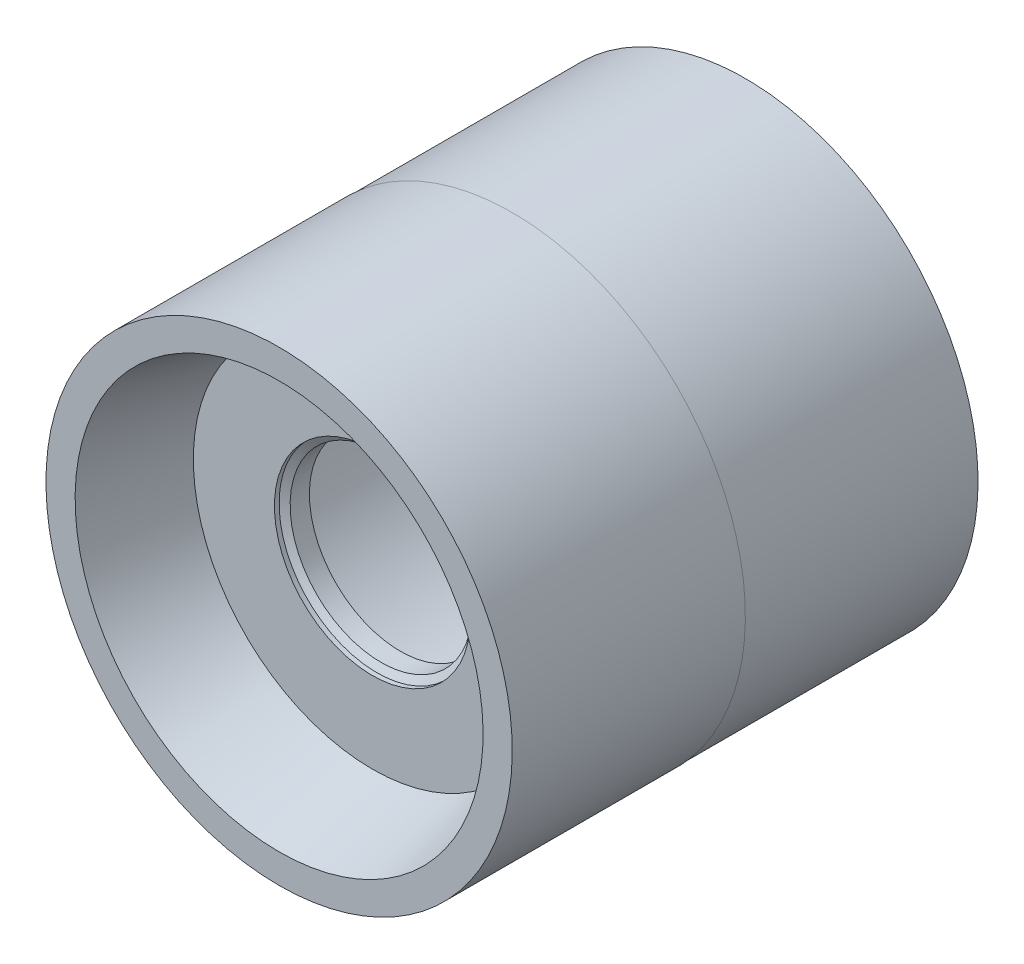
ISO-10303-21;
HEADER;
FILE_DESCRIPTION(('STEP AP214'),'2;1');
FILE_NAME('part.step','',(''),(''),'','','');
FILE_SCHEMA(('AUTOMOTIVE_DESIGN { 1 0 10303 214 1 1 1 1 }'));
ENDSEC;
DATA;
#1=APPLICATION_CONTEXT('core data for automotive mechanical design processes');
#2=APPLICATION_PROTOCOL_DEFINITION('international standard','automotive_design',2000,#1);
#3=PRODUCT_CONTEXT('',#1,'mechanical');
#4=PRODUCT('Part','Part','',(#3));
#5=PRODUCT_RELATED_PRODUCT_CATEGORY('part','',(#4));
#6=PRODUCT_DEFINITION_FORMATION('','',#4);
#7=PRODUCT_DEFINITION_CONTEXT('part definition',#1,'design');
#8=PRODUCT_DEFINITION('design','',#6,#7);
#9=PRODUCT_DEFINITION_SHAPE('','',#8);
#10=(LENGTH_UNIT() NAMED_UNIT(*) SI_UNIT(.MILLI.,.METRE.));
#11=(NAMED_UNIT(*) PLANE_ANGLE_UNIT() SI_UNIT($,.RADIAN.));
#12=(NAMED_UNIT(*) SI_UNIT($,.STERADIAN.) SOLID_ANGLE_UNIT());
#13=UNCERTAINTY_MEASURE_WITH_UNIT(LENGTH_MEASURE(1.E-05),#10,'distance_accuracy_value','');
#14=(GEOMETRIC_REPRESENTATION_CONTEXT(3) GLOBAL_UNCERTAINTY_ASSIGNED_CONTEXT((#13)) GLOBAL_UNIT_ASSIGNED_CONTEXT((#10,
#11,#12)) REPRESENTATION_CONTEXT('',''));
#15=CARTESIAN_POINT('',(0.,0.,0.));
#16=DIRECTION('',(0.,0.,1.));
#17=DIRECTION('',(1.,0.,0.));
#18=AXIS2_PLACEMENT_3D('',#15,#16,#17);
#19=CARTESIAN_POINT('',(0.,0.,0.));
#20=DIRECTION('',(0.,0.,-1.));
#21=DIRECTION('',(0.,1.,0.));
#22=AXIS2_PLACEMENT_3D('',#19,#20,#21);
#23=CYLINDRICAL_SURFACE('',#22,4.953);
#24=CARTESIAN_POINT('',(0.,0.,-5.55397045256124));
#25=DIRECTION('',(0.,0.,1.));
#26=DIRECTION('',(1.,0.,0.));
#27=AXIS2_PLACEMENT_3D('',#24,#25,#26);
#28=CIRCLE('',#27,4.953);
#29=CARTESIAN_POINT('',(4.953,0.,-5.55397045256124));
#30=VERTEX_POINT('',#29);
#31=EDGE_CURVE('E179',#30,#30,#28,.T.);
#32=ORIENTED_EDGE('',*,*,#31,.T.);
#33=EDGE_LOOP('',(#32));
#34=FACE_BOUND('',#33,.T.);
#35=CARTESIAN_POINT('',(0.,0.,-6.604));
#36=DIRECTION('',(0.,0.,-1.));
#37=DIRECTION('',(0.,1.,0.));
#38=AXIS2_PLACEMENT_3D('',#35,#36,#37);
#39=CIRCLE('',#38,4.953);
#40=CARTESIAN_POINT('',(0.,4.95299999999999,-6.604));
#41=VERTEX_POINT('',#40);
#42=EDGE_CURVE('E39',#41,#41,#39,.F.);
#43=ORIENTED_EDGE('',*,*,#42,.F.);
#44=EDGE_LOOP('',(#43));
#45=FACE_BOUND('',#44,.T.);
#46=ADVANCED_FACE('F35',(#34,#45),#23,.F.);
#47=CARTESIAN_POINT('',(0.,12.6746,-25.4));
#48=DIRECTION('',(0.,0.,1.));
#49=DIRECTION('',(0.,-1.,0.));
#50=AXIS2_PLACEMENT_3D('',#47,#48,#49);
#51=PLANE('',#50);
#52=CARTESIAN_POINT('',(0.,0.,-25.4));
#53=DIRECTION('',(0.,0.,1.));
#54=DIRECTION('',(0.,-1.,0.));
#55=AXIS2_PLACEMENT_3D('',#52,#53,#54);
#56=CIRCLE('',#55,12.6746);
#57=CARTESIAN_POINT('',(0.,-12.6746,-25.4));
#58=VERTEX_POINT('',#57);
#59=EDGE_CURVE('E164',#58,#58,#56,.T.);
#60=ORIENTED_EDGE('',*,*,#59,.F.);
#61=EDGE_LOOP('',(#60));
#62=FACE_BOUND('',#61,.T.);
#63=DIRECTION('',(0.,-1.,0.));
#64=VECTOR('',#63,1.);
#65=CARTESIAN_POINT('',(1.778,12.6746,-25.4));
#66=LINE('',#65,#64);
#67=CARTESIAN_POINT('',(1.778,-9.874198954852,-25.4));
#68=VERTEX_POINT('',#67);
#69=CARTESIAN_POINT('',(1.778,-12.192,-25.4));
#70=VERTEX_POINT('',#69);
#71=EDGE_CURVE('E137',#68,#70,#66,.T.);
#72=ORIENTED_EDGE('',*,*,#71,.F.);
#73=CARTESIAN_POINT('',(0.,0.,-25.4));
#74=DIRECTION('',(0.,0.,-1.));
#75=DIRECTION('',(0.,1.,0.));
#76=AXIS2_PLACEMENT_3D('',#73,#74,#75);
#77=CIRCLE('',#76,10.033);
#78=CARTESIAN_POINT('',(1.778,9.87419895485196,-25.4));
#79=VERTEX_POINT('',#78);
#80=EDGE_CURVE('E124',#79,#68,#77,.T.);
#81=ORIENTED_EDGE('',*,*,#80,.F.);
#82=CARTESIAN_POINT('',(1.778,12.192,-25.4));
#83=VERTEX_POINT('',#82);
#84=EDGE_CURVE('E135',#83,#79,#66,.T.);
#85=ORIENTED_EDGE('',*,*,#84,.F.);
#86=DIRECTION('',(1.,0.,0.));
#87=VECTOR('',#86,1.);
#88=CARTESIAN_POINT('',(0.,12.192,-25.4));
#89=LINE('',#88,#87);
#90=CARTESIAN_POINT('',(-1.778,12.192,-25.4));
#91=VERTEX_POINT('',#90);
#92=EDGE_CURVE('E145',#91,#83,#89,.T.);
#93=ORIENTED_EDGE('',*,*,#92,.F.);
#94=DIRECTION('',(0.,1.,0.));
#95=VECTOR('',#94,1.);
#96=CARTESIAN_POINT('',(-1.778,12.6746,-25.4));
#97=LINE('',#96,#95);
#98=CARTESIAN_POINT('',(-1.778,9.87419895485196,-25.4));
#99=VERTEX_POINT('',#98);
#100=EDGE_CURVE('E44',#99,#91,#97,.T.);
#101=ORIENTED_EDGE('',*,*,#100,.F.);
#102=CARTESIAN_POINT('',(-1.778,-9.874198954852,-25.4));
#103=VERTEX_POINT('',#102);
#104=EDGE_CURVE('E139',#103,#99,#77,.T.);
#105=ORIENTED_EDGE('',*,*,#104,.F.);
#106=CARTESIAN_POINT('',(-1.778,-12.192,-25.4));
#107=VERTEX_POINT('',#106);
#108=EDGE_CURVE('E148',#107,#103,#97,.T.);
#109=ORIENTED_EDGE('',*,*,#108,.F.);
#110=DIRECTION('',(1.,0.,0.));
#111=VECTOR('',#110,1.);
#112=CARTESIAN_POINT('',(0.,-12.192,-25.4));
#113=LINE('',#112,#111);
#114=EDGE_CURVE('E151',#107,#70,#113,.T.);
#115=ORIENTED_EDGE('',*,*,#114,.T.);
#116=EDGE_LOOP('',(#72,#81,#85,#93,#101,#105,#109,#115));
#117=FACE_BOUND('',#116,.T.);
#118=ADVANCED_FACE('F133',(#62,#117),#51,.F.);
#119=CARTESIAN_POINT('',(0.,0.,0.));
#120=DIRECTION('',(0.,0.,1.));
#121=DIRECTION('',(0.,-1.,0.));
#122=AXIS2_PLACEMENT_3D('',#119,#120,#121);
#123=CYLINDRICAL_SURFACE('',#122,12.7);
#124=CARTESIAN_POINT('',(0.,0.,0.));
#125=DIRECTION('',(0.,0.,1.));
#126=DIRECTION('',(0.,-1.,0.));
#127=AXIS2_PLACEMENT_3D('',#124,#125,#126);
#128=CIRCLE('',#127,12.7);
#129=CARTESIAN_POINT('',(0.,-12.7,0.));
#130=VERTEX_POINT('',#129);
#131=EDGE_CURVE('E173',#130,#130,#128,.T.);
#132=ORIENTED_EDGE('',*,*,#131,.F.);
#133=EDGE_LOOP('',(#132));
#134=FACE_BOUND('',#133,.T.);
#135=CARTESIAN_POINT('',(0.,0.,-12.7));
#136=DIRECTION('',(0.,0.,1.));
#137=DIRECTION('',(0.,-1.,0.));
#138=AXIS2_PLACEMENT_3D('',#135,#136,#137);
#139=CIRCLE('',#138,12.7);
#140=CARTESIAN_POINT('',(0.,-12.7,-12.7));
#141=VERTEX_POINT('',#140);
#142=EDGE_CURVE('E156',#141,#141,#139,.T.);
#143=ORIENTED_EDGE('',*,*,#142,.T.);
#144=EDGE_LOOP('',(#143));
#145=FACE_BOUND('',#144,.T.);
#146=ADVANCED_FACE('F37',(#134,#145),#123,.T.);
#147=CARTESIAN_POINT('',(0.,12.7,-12.7));
#148=DIRECTION('',(0.,0.,1.));
#149=DIRECTION('',(0.,-1.,0.));
#150=AXIS2_PLACEMENT_3D('',#147,#148,#149);
#151=PLANE('',#150);
#152=ORIENTED_EDGE('',*,*,#142,.F.);
#153=EDGE_LOOP('',(#152));
#154=FACE_BOUND('',#153,.T.);
#155=CARTESIAN_POINT('',(0.,0.,-12.7));
#156=DIRECTION('',(0.,0.,1.));
#157=DIRECTION('',(0.,-1.,0.));
#158=AXIS2_PLACEMENT_3D('',#155,#156,#157);
#159=CIRCLE('',#158,12.6746);
#160=CARTESIAN_POINT('',(0.,-12.6746,-12.7));
#161=VERTEX_POINT('',#160);
#162=EDGE_CURVE('E159',#161,#161,#159,.T.);
#163=ORIENTED_EDGE('',*,*,#162,.T.);
#164=EDGE_LOOP('',(#163));
#165=FACE_BOUND('',#164,.T.);
#166=ADVANCED_FACE('F309',(#154,#165),#151,.F.);
#167=CARTESIAN_POINT('',(0.,0.,0.));
#168=DIRECTION('',(0.,0.,1.));
#169=DIRECTION('',(0.,-1.,0.));
#170=AXIS2_PLACEMENT_3D('',#167,#168,#169);
#171=CYLINDRICAL_SURFACE('',#170,12.6746);
#172=ORIENTED_EDGE('',*,*,#162,.F.);
#173=EDGE_LOOP('',(#172));
#174=FACE_BOUND('',#173,.T.);
#175=ORIENTED_EDGE('',*,*,#59,.T.);
#176=EDGE_LOOP('',(#175));
#177=FACE_BOUND('',#176,.T.);
#178=ADVANCED_FACE('F303',(#174,#177),#171,.T.);
#179=CARTESIAN_POINT('',(0.,9.75131810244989,-5.08));
#180=DIRECTION('',(0.,0.,-1.));
#181=DIRECTION('',(0.,1.,0.));
#182=AXIS2_PLACEMENT_3D('',#179,#180,#181);
#183=PLANE('',#182);
#184=CARTESIAN_POINT('',(0.,0.,-5.08));
#185=DIRECTION('',(0.,0.,1.));
#186=DIRECTION('',(1.,0.,0.));
#187=AXIS2_PLACEMENT_3D('',#184,#185,#186);
#188=CIRCLE('',#187,5.334);
#189=CARTESIAN_POINT('',(5.334,0.,-5.08));
#190=VERTEX_POINT('',#189);
#191=EDGE_CURVE('E176',#190,#190,#188,.T.);
#192=ORIENTED_EDGE('',*,*,#191,.F.);
#193=EDGE_LOOP('',(#192));
#194=FACE_BOUND('',#193,.T.);
#195=CARTESIAN_POINT('',(0.,0.,-5.07999999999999));
#196=DIRECTION('',(0.,0.,1.));
#197=DIRECTION('',(0.,-1.,0.));
#198=AXIS2_PLACEMENT_3D('',#195,#196,#197);
#199=CIRCLE('',#198,9.7513181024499);
#200=CARTESIAN_POINT('',(0.,-9.7513181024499,-5.07999999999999));
#201=VERTEX_POINT('',#200);
#202=EDGE_CURVE('E167',#201,#201,#199,.T.);
#203=ORIENTED_EDGE('',*,*,#202,.T.);
#204=EDGE_LOOP('',(#203));
#205=FACE_BOUND('',#204,.T.);
#206=ADVANCED_FACE('F299',(#194,#205),#183,.F.);
#207=CARTESIAN_POINT('',(0.,0.,0.));
#208=DIRECTION('',(0.,0.,1.));
#209=DIRECTION('',(0.,-1.,0.));
#210=AXIS2_PLACEMENT_3D('',#207,#208,#209);
#211=CONICAL_SURFACE('',#210,11.1125,0.261799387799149);
#212=ORIENTED_EDGE('',*,*,#202,.F.);
#213=EDGE_LOOP('',(#212));
#214=FACE_BOUND('',#213,.T.);
#215=CARTESIAN_POINT('',(0.,0.,0.));
#216=DIRECTION('',(0.,0.,1.));
#217=DIRECTION('',(0.,-1.,0.));
#218=AXIS2_PLACEMENT_3D('',#215,#216,#217);
#219=CIRCLE('',#218,11.1125);
#220=CARTESIAN_POINT('',(0.,-11.1125,0.));
#221=VERTEX_POINT('',#220);
#222=EDGE_CURVE('E170',#221,#221,#219,.T.);
#223=ORIENTED_EDGE('',*,*,#222,.T.);
#224=EDGE_LOOP('',(#223));
#225=FACE_BOUND('',#224,.T.);
#226=ADVANCED_FACE('F295',(#214,#225),#211,.F.);
#227=CARTESIAN_POINT('',(0.,11.1125,0.));
#228=DIRECTION('',(0.,0.,-1.));
#229=DIRECTION('',(0.,1.,0.));
#230=AXIS2_PLACEMENT_3D('',#227,#228,#229);
#231=PLANE('',#230);
#232=ORIENTED_EDGE('',*,*,#222,.F.);
#233=EDGE_LOOP('',(#232));
#234=FACE_BOUND('',#233,.T.);
#235=ORIENTED_EDGE('',*,*,#131,.T.);
#236=EDGE_LOOP('',(#235));
#237=FACE_BOUND('',#236,.T.);
#238=ADVANCED_FACE('F288',(#234,#237),#231,.F.);
#239=CARTESIAN_POINT('',(0.,0.,-5.334));
#240=DIRECTION('',(0.,0.,1.));
#241=DIRECTION('',(1.,0.,0.));
#242=AXIS2_PLACEMENT_3D('',#239,#240,#241);
#243=CYLINDRICAL_SURFACE('',#242,5.334);
#244=CARTESIAN_POINT('',(0.,0.,-5.334));
#245=DIRECTION('',(0.,0.,1.));
#246=DIRECTION('',(1.,0.,0.));
#247=AXIS2_PLACEMENT_3D('',#244,#245,#246);
#248=CIRCLE('',#247,5.334);
#249=CARTESIAN_POINT('',(5.334,0.,-5.334));
#250=VERTEX_POINT('',#249);
#251=EDGE_CURVE('E182',#250,#250,#248,.T.);
#252=ORIENTED_EDGE('',*,*,#251,.F.);
#253=EDGE_LOOP('',(#252));
#254=FACE_BOUND('',#253,.T.);
#255=ORIENTED_EDGE('',*,*,#191,.T.);
#256=EDGE_LOOP('',(#255));
#257=FACE_BOUND('',#256,.T.);
#258=ADVANCED_FACE('F284',(#254,#257),#243,.F.);
#259=CARTESIAN_POINT('',(0.,0.,-5.334));
#260=DIRECTION('',(0.,0.,1.));
#261=DIRECTION('',(1.,0.,0.));
#262=AXIS2_PLACEMENT_3D('',#259,#260,#261);
#263=CONICAL_SURFACE('',#262,5.334,1.0471975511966);
#264=ORIENTED_EDGE('',*,*,#251,.T.);
#265=EDGE_LOOP('',(#264));
#266=FACE_BOUND('',#265,.T.);
#267=ORIENTED_EDGE('',*,*,#31,.F.);
#268=EDGE_LOOP('',(#267));
#269=FACE_BOUND('',#268,.T.);
#270=ADVANCED_FACE('F281',(#266,#269),#263,.F.);
#271=CARTESIAN_POINT('',(-0.127,-12.192,-26.543));
#272=DIRECTION('',(0.,-1.,0.));
#273=DIRECTION('',(0.,0.,-1.));
#274=AXIS2_PLACEMENT_3D('',#271,#272,#273);
#275=PLANE('',#274);
#276=DIRECTION('',(0.,0.,1.));
#277=VECTOR('',#276,1.);
#278=CARTESIAN_POINT('',(-1.778,-12.192,-20.828));
#279=LINE('',#278,#277);
#280=CARTESIAN_POINT('',(-1.778,-12.192,-20.828));
#281=VERTEX_POINT('',#280);
#282=EDGE_CURVE('E220',#107,#281,#279,.T.);
#283=ORIENTED_EDGE('',*,*,#282,.T.);
#284=CARTESIAN_POINT('',(-0.127,-12.192,-20.828));
#285=DIRECTION('',(0.,1.,0.));
#286=DIRECTION('',(0.,0.,1.));
#287=AXIS2_PLACEMENT_3D('',#284,#285,#286);
#288=CIRCLE('',#287,1.651);
#289=CARTESIAN_POINT('',(-0.127,-12.192,-19.177));
#290=VERTEX_POINT('',#289);
#291=EDGE_CURVE('E217',#281,#290,#288,.T.);
#292=ORIENTED_EDGE('',*,*,#291,.T.);
#293=DIRECTION('',(1.,0.,0.));
#294=VECTOR('',#293,1.);
#295=CARTESIAN_POINT('',(0.127000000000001,-12.192,-19.177));
#296=LINE('',#295,#294);
#297=CARTESIAN_POINT('',(0.127000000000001,-12.192,-19.177));
#298=VERTEX_POINT('',#297);
#299=EDGE_CURVE('E214',#290,#298,#296,.T.);
#300=ORIENTED_EDGE('',*,*,#299,.T.);
#301=CARTESIAN_POINT('',(0.127000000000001,-12.192,-20.828));
#302=DIRECTION('',(0.,1.,0.));
#303=DIRECTION('',(0.,0.,1.));
#304=AXIS2_PLACEMENT_3D('',#301,#302,#303);
#305=CIRCLE('',#304,1.651);
#306=CARTESIAN_POINT('',(1.778,-12.192,-20.828));
#307=VERTEX_POINT('',#306);
#308=EDGE_CURVE('E211',#298,#307,#305,.T.);
#309=ORIENTED_EDGE('',*,*,#308,.T.);
#310=DIRECTION('',(0.,0.,-1.));
#311=VECTOR('',#310,1.);
#312=CARTESIAN_POINT('',(1.778,-12.192,-26.543));
#313=LINE('',#312,#311);
#314=EDGE_CURVE('E209',#307,#70,#313,.T.);
#315=ORIENTED_EDGE('',*,*,#314,.T.);
#316=ORIENTED_EDGE('',*,*,#114,.F.);
#317=EDGE_LOOP('',(#283,#292,#300,#309,#315,#316));
#318=FACE_BOUND('',#317,.T.);
#319=ADVANCED_FACE('F245',(#318),#275,.F.);
#320=CARTESIAN_POINT('',(1.778,12.192,-26.543));
#321=DIRECTION('',(-1.,0.,0.));
#322=DIRECTION('',(0.,0.,1.));
#323=AXIS2_PLACEMENT_3D('',#320,#321,#322);
#324=PLANE('',#323);
#325=DIRECTION('',(0.,0.,-1.));
#326=VECTOR('',#325,1.);
#327=CARTESIAN_POINT('',(1.778,-9.87419895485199,-6.60399999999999));
#328=LINE('',#327,#326);
#329=CARTESIAN_POINT('',(1.778,-9.874198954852,-20.828));
#330=VERTEX_POINT('',#329);
#331=EDGE_CURVE('E223',#68,#330,#328,.F.);
#332=ORIENTED_EDGE('',*,*,#331,.F.);
#333=ORIENTED_EDGE('',*,*,#71,.T.);
#334=ORIENTED_EDGE('',*,*,#314,.F.);
#335=DIRECTION('',(0.,-1.,0.));
#336=VECTOR('',#335,1.);
#337=CARTESIAN_POINT('',(1.778,12.192,-20.828));
#338=LINE('',#337,#336);
#339=EDGE_CURVE('E199',#330,#307,#338,.T.);
#340=ORIENTED_EDGE('',*,*,#339,.F.);
#341=EDGE_LOOP('',(#332,#333,#334,#340));
#342=FACE_BOUND('',#341,.T.);
#343=ADVANCED_FACE('F278',(#342),#324,.T.);
#344=CARTESIAN_POINT('',(-1.778,12.192,-20.828));
#345=DIRECTION('',(1.,0.,0.));
#346=DIRECTION('',(0.,0.,-1.));
#347=AXIS2_PLACEMENT_3D('',#344,#345,#346);
#348=PLANE('',#347);
#349=DIRECTION('',(0.,0.,-1.));
#350=VECTOR('',#349,1.);
#351=CARTESIAN_POINT('',(-1.778,-9.87419895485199,-6.60399999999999));
#352=LINE('',#351,#350);
#353=CARTESIAN_POINT('',(-1.778,-9.874198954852,-20.828));
#354=VERTEX_POINT('',#353);
#355=EDGE_CURVE('E225',#354,#103,#352,.T.);
#356=ORIENTED_EDGE('',*,*,#355,.F.);
#357=DIRECTION('',(0.,-1.,0.));
#358=VECTOR('',#357,1.);
#359=CARTESIAN_POINT('',(-1.778,12.192,-20.828));
#360=LINE('',#359,#358);
#361=EDGE_CURVE('E188',#354,#281,#360,.T.);
#362=ORIENTED_EDGE('',*,*,#361,.T.);
#363=ORIENTED_EDGE('',*,*,#282,.F.);
#364=ORIENTED_EDGE('',*,*,#108,.T.);
#365=EDGE_LOOP('',(#356,#362,#363,#364));
#366=FACE_BOUND('',#365,.T.);
#367=ADVANCED_FACE('F274',(#366),#348,.T.);
#368=CARTESIAN_POINT('',(0.127000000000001,12.192,-20.828));
#369=DIRECTION('',(0.,-1.,0.));
#370=DIRECTION('',(0.,0.,-1.));
#371=AXIS2_PLACEMENT_3D('',#368,#369,#370);
#372=CYLINDRICAL_SURFACE('',#371,1.651);
#373=CARTESIAN_POINT('',(1.778,-9.874198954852,-20.828));
#374=CARTESIAN_POINT('',(1.77800012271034,-9.87419704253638,-20.7819476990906));
#375=CARTESIAN_POINT('',(1.77607193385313,-9.87454633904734,-20.7359178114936));
#376=CARTESIAN_POINT('',(1.7683824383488,-9.87592705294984,-20.644194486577));
#377=CARTESIAN_POINT('',(1.76262153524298,-9.87695839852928,-20.5985010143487));
#378=CARTESIAN_POINT('',(1.73965937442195,-9.88103896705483,-20.4625550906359));
#379=CARTESIAN_POINT('',(1.71677841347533,-9.8850749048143,-20.3732243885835));
#380=CARTESIAN_POINT('',(1.65655765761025,-9.89534368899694,-20.1997490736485));
#381=CARTESIAN_POINT('',(1.61921480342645,-9.9015770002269,-20.1156055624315));
#382=CARTESIAN_POINT('',(1.53115725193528,-9.91557496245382,-19.9547611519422));
#383=CARTESIAN_POINT('',(1.48044179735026,-9.92333970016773,-19.8780606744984));
#384=CARTESIAN_POINT('',(1.36650190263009,-9.93967285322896,-19.7334717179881));
#385=CARTESIAN_POINT('',(1.30316088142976,-9.94824833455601,-19.6656759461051));
#386=CARTESIAN_POINT('',(1.16601038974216,-9.9652533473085,-19.5416059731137));
#387=CARTESIAN_POINT('',(1.09219882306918,-9.97368284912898,-19.4853340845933));
#388=CARTESIAN_POINT('',(0.935504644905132,-9.98960282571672,-19.3854943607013));
#389=CARTESIAN_POINT('',(0.852554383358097,-9.99708527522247,-19.3420314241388));
#390=CARTESIAN_POINT('',(0.680406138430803,-10.01027307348,-19.2697176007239));
#391=CARTESIAN_POINT('',(0.59121237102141,-10.0159796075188,-19.2408569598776));
#392=CARTESIAN_POINT('',(0.439091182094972,-10.023574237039,-19.205549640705));
#393=CARTESIAN_POINT('',(0.377148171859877,-10.0261008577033,-19.1948556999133));
#394=CARTESIAN_POINT('',(0.252482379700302,-10.0300184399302,-19.1805794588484));
#395=CARTESIAN_POINT('',(0.189760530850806,-10.0314106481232,-19.1769893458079));
#396=CARTESIAN_POINT('',(0.127000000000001,-10.0321961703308,-19.177));
#397=B_SPLINE_CURVE_WITH_KNOTS('',3,(#373,#374,#375,#376,#377,#378,#379,#380,#381,#382,#383,
#384,#385,#386,#387,#388,#389,#390,#391,#392,#393,#394,#395,#396),.UNSPECIFIED.,.F.,.F.,(4,2,2,
2,2,2,2,2,2,2,2,4),(0.,0.138070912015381,0.276127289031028,0.551610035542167,0.827151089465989,
1.10270775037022,1.38093768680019,1.65922340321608,1.93972855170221,2.22004608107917,
2.4083851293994,2.59651692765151),.UNSPECIFIED.);
#398=CARTESIAN_POINT('',(0.127000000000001,-10.0321961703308,-19.177));
#399=VERTEX_POINT('',#398);
#400=EDGE_CURVE('E227',#330,#399,#397,.T.);
#401=ORIENTED_EDGE('',*,*,#400,.F.);
#402=ORIENTED_EDGE('',*,*,#339,.T.);
#403=ORIENTED_EDGE('',*,*,#308,.F.);
#404=DIRECTION('',(0.,-1.,0.));
#405=VECTOR('',#404,1.);
#406=CARTESIAN_POINT('',(0.127000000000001,12.192,-19.177));
#407=LINE('',#406,#405);
#408=EDGE_CURVE('E196',#399,#298,#407,.T.);
#409=ORIENTED_EDGE('',*,*,#408,.F.);
#410=EDGE_LOOP('',(#401,#402,#403,#409));
#411=FACE_BOUND('',#410,.T.);
#412=ADVANCED_FACE('F236',(#411),#372,.F.);
#413=CARTESIAN_POINT('',(0.127000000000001,12.192,-19.177));
#414=DIRECTION('',(0.,0.,-1.));
#415=DIRECTION('',(-1.,0.,0.));
#416=AXIS2_PLACEMENT_3D('',#413,#414,#415);
#417=PLANE('',#416);
#418=CARTESIAN_POINT('',(0.,0.,-19.177));
#419=DIRECTION('',(0.,0.,-1.));
#420=DIRECTION('',(-1.,0.,0.));
#421=AXIS2_PLACEMENT_3D('',#418,#419,#420);
#422=CIRCLE('',#421,10.033);
#423=CARTESIAN_POINT('',(-0.127,-10.0321961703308,-19.177));
#424=VERTEX_POINT('',#423);
#425=EDGE_CURVE('E234',#399,#424,#422,.T.);
#426=ORIENTED_EDGE('',*,*,#425,.F.);
#427=ORIENTED_EDGE('',*,*,#408,.T.);
#428=ORIENTED_EDGE('',*,*,#299,.F.);
#429=DIRECTION('',(0.,-1.,0.));
#430=VECTOR('',#429,1.);
#431=CARTESIAN_POINT('',(-0.127,12.192,-19.177));
#432=LINE('',#431,#430);
#433=EDGE_CURVE('E192',#424,#290,#432,.T.);
#434=ORIENTED_EDGE('',*,*,#433,.F.);
#435=EDGE_LOOP('',(#426,#427,#428,#434));
#436=FACE_BOUND('',#435,.T.);
#437=ADVANCED_FACE('F272',(#436),#417,.T.);
#438=CARTESIAN_POINT('',(-0.127,12.192,-20.828));
#439=DIRECTION('',(0.,-1.,0.));
#440=DIRECTION('',(0.,0.,-1.));
#441=AXIS2_PLACEMENT_3D('',#438,#439,#440);
#442=CYLINDRICAL_SURFACE('',#441,1.651);
#443=CARTESIAN_POINT('',(-0.127,-10.0321961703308,-19.177));
#444=CARTESIAN_POINT('',(-0.173183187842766,-10.0316133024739,-19.1769999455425));
#445=CARTESIAN_POINT('',(-0.219339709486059,-10.0307078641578,-19.1789390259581));
#446=CARTESIAN_POINT('',(-0.311307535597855,-10.0282744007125,-19.1866703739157));
#447=CARTESIAN_POINT('',(-0.357118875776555,-10.0267464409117,-19.1924622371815));
#448=CARTESIAN_POINT('',(-0.493410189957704,-10.0212704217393,-19.2155458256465));
#449=CARTESIAN_POINT('',(-0.582954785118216,-10.0164274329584,-19.2385458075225));
#450=CARTESIAN_POINT('',(-0.756820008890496,-10.0047952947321,-19.299073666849));
#451=CARTESIAN_POINT('',(-0.841139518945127,-9.99800573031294,-19.3366046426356));
#452=CARTESIAN_POINT('',(-1.00229074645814,-9.98313840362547,-19.4251052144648));
#453=CARTESIAN_POINT('',(-1.07912213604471,-9.97506058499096,-19.4760753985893));
#454=CARTESIAN_POINT('',(-1.22386208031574,-9.95834404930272,-19.5905485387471));
#455=CARTESIAN_POINT('',(-1.29168459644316,-9.94970095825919,-19.6541596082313));
#456=CARTESIAN_POINT('',(-1.41574744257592,-9.93280813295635,-19.7918912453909));
#457=CARTESIAN_POINT('',(-1.47198556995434,-9.92455847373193,-19.8660138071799));
#458=CARTESIAN_POINT('',(-1.57155224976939,-9.90928214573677,-20.0231576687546));
#459=CARTESIAN_POINT('',(-1.61480899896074,-9.90226236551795,-20.1062251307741));
#460=CARTESIAN_POINT('',(-1.68669177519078,-9.89027280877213,-20.2785773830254));
#461=CARTESIAN_POINT('',(-1.71532801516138,-9.8853016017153,-20.3678577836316));
#462=CARTESIAN_POINT('',(-1.75009047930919,-9.87919385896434,-20.5193956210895));
#463=CARTESIAN_POINT('',(-1.76054594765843,-9.87733028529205,-20.580665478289));
#464=CARTESIAN_POINT('',(-1.77450197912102,-9.87482889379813,-20.7039472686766));
#465=CARTESIAN_POINT('',(-1.7780102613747,-9.87418971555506,-20.7659583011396));
#466=CARTESIAN_POINT('',(-1.778,-9.874198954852,-20.828));
#467=B_SPLINE_CURVE_WITH_KNOTS('',3,(#443,#444,#445,#446,#447,#448,#449,#450,#451,#452,#453,
#454,#455,#456,#457,#458,#459,#460,#461,#462,#463,#464,#465,#466),.UNSPECIFIED.,.F.,.F.,(4,2,2,
2,2,2,2,2,2,2,2,4),(0.,0.138474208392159,0.276933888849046,0.553239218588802,0.829603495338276,
1.10597986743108,1.3848304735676,1.66373405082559,1.94415302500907,2.22437584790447,
2.41054677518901,2.59651072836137),.UNSPECIFIED.);
#468=EDGE_CURVE('E262',#424,#354,#467,.T.);
#469=ORIENTED_EDGE('',*,*,#468,.F.);
#470=ORIENTED_EDGE('',*,*,#433,.T.);
#471=ORIENTED_EDGE('',*,*,#291,.F.);
#472=ORIENTED_EDGE('',*,*,#361,.F.);
#473=EDGE_LOOP('',(#469,#470,#471,#472));
#474=FACE_BOUND('',#473,.T.);
#475=ADVANCED_FACE('F267',(#474),#442,.F.);
#476=CARTESIAN_POINT('',(-1.778,9.87419895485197,-20.828));
#477=CARTESIAN_POINT('',(-1.77800012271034,9.87419704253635,-20.7819476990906));
#478=CARTESIAN_POINT('',(-1.77607193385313,9.87454633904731,-20.7359178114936));
#479=CARTESIAN_POINT('',(-1.7683824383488,9.87592705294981,-20.644194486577));
#480=CARTESIAN_POINT('',(-1.76262153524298,9.87695839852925,-20.5985010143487));
#481=CARTESIAN_POINT('',(-1.73965937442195,9.8810389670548,-20.4625550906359));
#482=CARTESIAN_POINT('',(-1.71677841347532,9.88507490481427,-20.3732243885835));
#483=CARTESIAN_POINT('',(-1.65655765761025,9.89534368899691,-20.1997490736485));
#484=CARTESIAN_POINT('',(-1.61921480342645,9.90157700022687,-20.1156055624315));
#485=CARTESIAN_POINT('',(-1.53115725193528,9.91557496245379,-19.9547611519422));
#486=CARTESIAN_POINT('',(-1.48044179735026,9.9233397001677,-19.8780606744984));
#487=CARTESIAN_POINT('',(-1.36650190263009,9.93967285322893,-19.7334717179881));
#488=CARTESIAN_POINT('',(-1.30316088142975,9.94824833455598,-19.6656759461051));
#489=CARTESIAN_POINT('',(-1.16601038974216,9.96525334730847,-19.5416059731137));
#490=CARTESIAN_POINT('',(-1.09219882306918,9.97368284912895,-19.4853340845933));
#491=CARTESIAN_POINT('',(-0.935504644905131,9.9896028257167,-19.3854943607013));
#492=CARTESIAN_POINT('',(-0.852554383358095,9.99708527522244,-19.3420314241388));
#493=CARTESIAN_POINT('',(-0.680406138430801,10.01027307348,-19.2697176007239));
#494=CARTESIAN_POINT('',(-0.591212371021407,10.0159796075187,-19.2408569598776));
#495=CARTESIAN_POINT('',(-0.43909118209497,10.023574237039,-19.205549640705));
#496=CARTESIAN_POINT('',(-0.377148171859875,10.0261008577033,-19.1948556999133));
#497=CARTESIAN_POINT('',(-0.252482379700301,10.0300184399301,-19.1805794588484));
#498=CARTESIAN_POINT('',(-0.189760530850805,10.0314106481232,-19.1769893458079));
#499=CARTESIAN_POINT('',(-0.127000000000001,10.0321961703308,-19.177));
#500=B_SPLINE_CURVE_WITH_KNOTS('',3,(#476,#477,#478,#479,#480,#481,#482,#483,#484,#485,#486,
#487,#488,#489,#490,#491,#492,#493,#494,#495,#496,#497,#498,#499),.UNSPECIFIED.,.F.,.F.,(4,2,2,
2,2,2,2,2,2,2,2,4),(0.,0.138070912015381,0.276127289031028,0.551610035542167,0.827151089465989,
1.10270775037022,1.38093768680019,1.65922340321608,1.93972855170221,2.22004608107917,
2.4083851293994,2.59651692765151),.UNSPECIFIED.);
#501=CARTESIAN_POINT('',(-1.778,9.87419895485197,-20.828));
#502=VERTEX_POINT('',#501);
#503=CARTESIAN_POINT('',(-0.127,10.0321961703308,-19.177));
#504=VERTEX_POINT('',#503);
#505=EDGE_CURVE('E256',#502,#504,#500,.T.);
#506=ORIENTED_EDGE('',*,*,#505,.F.);
#507=CARTESIAN_POINT('',(-1.778,12.192,-20.828));
#508=VERTEX_POINT('',#507);
#509=EDGE_CURVE('E185',#508,#502,#360,.T.);
#510=ORIENTED_EDGE('',*,*,#509,.F.);
#511=CARTESIAN_POINT('',(-0.127,12.192,-20.828));
#512=DIRECTION('',(0.,1.,0.));
#513=DIRECTION('',(0.,0.,1.));
#514=AXIS2_PLACEMENT_3D('',#511,#512,#513);
#515=CIRCLE('',#514,1.651);
#516=CARTESIAN_POINT('',(-0.127,12.192,-19.177));
#517=VERTEX_POINT('',#516);
#518=EDGE_CURVE('E205',#508,#517,#515,.T.);
#519=ORIENTED_EDGE('',*,*,#518,.T.);
#520=EDGE_CURVE('E189',#517,#504,#432,.T.);
#521=ORIENTED_EDGE('',*,*,#520,.T.);
#522=EDGE_LOOP('',(#506,#510,#519,#521));
#523=FACE_BOUND('',#522,.T.);
#524=ADVANCED_FACE('F271',(#523),#442,.F.);
#525=CARTESIAN_POINT('',(0.,0.,-19.177));
#526=DIRECTION('',(0.,0.,-1.));
#527=DIRECTION('',(-1.,0.,0.));
#528=AXIS2_PLACEMENT_3D('',#525,#526,#527);
#529=CIRCLE('',#528,10.033);
#530=CARTESIAN_POINT('',(0.127000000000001,10.0321961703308,-19.177));
#531=VERTEX_POINT('',#530);
#532=EDGE_CURVE('E478',#504,#531,#529,.T.);
#533=ORIENTED_EDGE('',*,*,#532,.F.);
#534=ORIENTED_EDGE('',*,*,#520,.F.);
#535=DIRECTION('',(1.,0.,0.));
#536=VECTOR('',#535,1.);
#537=CARTESIAN_POINT('',(0.127000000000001,12.192,-19.177));
#538=LINE('',#537,#536);
#539=CARTESIAN_POINT('',(0.127000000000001,12.192,-19.177));
#540=VERTEX_POINT('',#539);
#541=EDGE_CURVE('E203',#517,#540,#538,.T.);
#542=ORIENTED_EDGE('',*,*,#541,.T.);
#543=EDGE_CURVE('E193',#540,#531,#407,.T.);
#544=ORIENTED_EDGE('',*,*,#543,.T.);
#545=EDGE_LOOP('',(#533,#534,#542,#544));
#546=FACE_BOUND('',#545,.T.);
#547=ADVANCED_FACE('F424',(#546),#417,.T.);
#548=CARTESIAN_POINT('',(0.127000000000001,10.0321961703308,-19.177));
#549=CARTESIAN_POINT('',(0.173183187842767,10.0316133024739,-19.1769999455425));
#550=CARTESIAN_POINT('',(0.21933970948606,10.0307078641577,-19.1789390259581));
#551=CARTESIAN_POINT('',(0.311307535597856,10.0282744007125,-19.1866703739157));
#552=CARTESIAN_POINT('',(0.357118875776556,10.0267464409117,-19.1924622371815));
#553=CARTESIAN_POINT('',(0.493410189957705,10.0212704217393,-19.2155458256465));
#554=CARTESIAN_POINT('',(0.582954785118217,10.0164274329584,-19.2385458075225));
#555=CARTESIAN_POINT('',(0.756820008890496,10.0047952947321,-19.299073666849));
#556=CARTESIAN_POINT('',(0.841139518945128,9.99800573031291,-19.3366046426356));
#557=CARTESIAN_POINT('',(1.00229074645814,9.98313840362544,-19.4251052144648));
#558=CARTESIAN_POINT('',(1.07912213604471,9.97506058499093,-19.4760753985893));
#559=CARTESIAN_POINT('',(1.22386208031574,9.95834404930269,-19.5905485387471));
#560=CARTESIAN_POINT('',(1.29168459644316,9.94970095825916,-19.6541596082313));
#561=CARTESIAN_POINT('',(1.41574744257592,9.93280813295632,-19.7918912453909));
#562=CARTESIAN_POINT('',(1.47198556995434,9.92455847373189,-19.8660138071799));
#563=CARTESIAN_POINT('',(1.57155224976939,9.90928214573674,-20.0231576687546));
#564=CARTESIAN_POINT('',(1.61480899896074,9.90226236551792,-20.1062251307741));
#565=CARTESIAN_POINT('',(1.68669177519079,9.8902728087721,-20.2785773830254));
#566=CARTESIAN_POINT('',(1.71532801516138,9.88530160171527,-20.3678577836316));
#567=CARTESIAN_POINT('',(1.75009047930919,9.8791938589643,-20.5193956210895));
#568=CARTESIAN_POINT('',(1.76054594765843,9.87733028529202,-20.580665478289));
#569=CARTESIAN_POINT('',(1.77450197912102,9.87482889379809,-20.7039472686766));
#570=CARTESIAN_POINT('',(1.7780102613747,9.87418971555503,-20.7659583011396));
#571=CARTESIAN_POINT('',(1.778,9.87419895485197,-20.828));
#572=B_SPLINE_CURVE_WITH_KNOTS('',3,(#548,#549,#550,#551,#552,#553,#554,#555,#556,#557,#558,
#559,#560,#561,#562,#563,#564,#565,#566,#567,#568,#569,#570,#571),.UNSPECIFIED.,.F.,.F.,(4,2,2,
2,2,2,2,2,2,2,2,4),(0.,0.138474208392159,0.276933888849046,0.553239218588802,0.829603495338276,
1.10597986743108,1.3848304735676,1.66373405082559,1.94415302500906,2.22437584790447,
2.41054677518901,2.59651072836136),.UNSPECIFIED.);
#573=CARTESIAN_POINT('',(1.778,9.87419895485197,-20.828));
#574=VERTEX_POINT('',#573);
#575=EDGE_CURVE('E50',#531,#574,#572,.T.);
#576=ORIENTED_EDGE('',*,*,#575,.F.);
#577=ORIENTED_EDGE('',*,*,#543,.F.);
#578=CARTESIAN_POINT('',(0.127000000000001,12.192,-20.828));
#579=DIRECTION('',(0.,1.,0.));
#580=DIRECTION('',(0.,0.,1.));
#581=AXIS2_PLACEMENT_3D('',#578,#579,#580);
#582=CIRCLE('',#581,1.651);
#583=CARTESIAN_POINT('',(1.778,12.192,-20.828));
#584=VERTEX_POINT('',#583);
#585=EDGE_CURVE('E201',#540,#584,#582,.T.);
#586=ORIENTED_EDGE('',*,*,#585,.T.);
#587=EDGE_CURVE('E197',#584,#574,#338,.T.);
#588=ORIENTED_EDGE('',*,*,#587,.T.);
#589=EDGE_LOOP('',(#576,#577,#586,#588));
#590=FACE_BOUND('',#589,.T.);
#591=ADVANCED_FACE('F418',(#590),#372,.F.);
#592=DIRECTION('',(0.,0.,-1.));
#593=VECTOR('',#592,1.);
#594=CARTESIAN_POINT('',(-1.778,9.87419895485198,-6.604));
#595=LINE('',#594,#593);
#596=EDGE_CURVE('E266',#99,#502,#595,.F.);
#597=ORIENTED_EDGE('',*,*,#596,.F.);
#598=ORIENTED_EDGE('',*,*,#100,.T.);
#599=DIRECTION('',(0.,0.,1.));
#600=VECTOR('',#599,1.);
#601=CARTESIAN_POINT('',(-1.778,12.192,-20.828));
#602=LINE('',#601,#600);
#603=EDGE_CURVE('E207',#91,#508,#602,.T.);
#604=ORIENTED_EDGE('',*,*,#603,.T.);
#605=ORIENTED_EDGE('',*,*,#509,.T.);
#606=EDGE_LOOP('',(#597,#598,#604,#605));
#607=FACE_BOUND('',#606,.T.);
#608=ADVANCED_FACE('F280',(#607),#348,.T.);
#609=DIRECTION('',(0.,0.,-1.));
#610=VECTOR('',#609,1.);
#611=CARTESIAN_POINT('',(1.778,9.87419895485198,-6.604));
#612=LINE('',#611,#610);
#613=EDGE_CURVE('E11',#574,#79,#612,.T.);
#614=ORIENTED_EDGE('',*,*,#613,.F.);
#615=ORIENTED_EDGE('',*,*,#587,.F.);
#616=DIRECTION('',(0.,0.,-1.));
#617=VECTOR('',#616,1.);
#618=CARTESIAN_POINT('',(1.778,12.192,-26.543));
#619=LINE('',#618,#617);
#620=EDGE_CURVE('E144',#584,#83,#619,.T.);
#621=ORIENTED_EDGE('',*,*,#620,.T.);
#622=ORIENTED_EDGE('',*,*,#84,.T.);
#623=EDGE_LOOP('',(#614,#615,#621,#622));
#624=FACE_BOUND('',#623,.T.);
#625=ADVANCED_FACE('F142',(#624),#324,.T.);
#626=CARTESIAN_POINT('',(-0.127,12.192,-26.543));
#627=DIRECTION('',(0.,-1.,0.));
#628=DIRECTION('',(0.,0.,-1.));
#629=AXIS2_PLACEMENT_3D('',#626,#627,#628);
#630=PLANE('',#629);
#631=ORIENTED_EDGE('',*,*,#92,.T.);
#632=ORIENTED_EDGE('',*,*,#620,.F.);
#633=ORIENTED_EDGE('',*,*,#585,.F.);
#634=ORIENTED_EDGE('',*,*,#541,.F.);
#635=ORIENTED_EDGE('',*,*,#518,.F.);
#636=ORIENTED_EDGE('',*,*,#603,.F.);
#637=EDGE_LOOP('',(#631,#632,#633,#634,#635,#636));
#638=FACE_BOUND('',#637,.T.);
#639=ADVANCED_FACE('F343',(#638),#630,.T.);
#640=CARTESIAN_POINT('',(0.,0.,-6.604));
#641=DIRECTION('',(0.,0.,-1.));
#642=DIRECTION('',(0.,1.,0.));
#643=AXIS2_PLACEMENT_3D('',#640,#641,#642);
#644=PLANE('',#643);
#645=CARTESIAN_POINT('',(0.,0.,-6.604));
#646=DIRECTION('',(0.,0.,-1.));
#647=DIRECTION('',(0.,1.,0.));
#648=AXIS2_PLACEMENT_3D('',#645,#646,#647);
#649=CIRCLE('',#648,10.033);
#650=CARTESIAN_POINT('',(0.,10.033,-6.604));
#651=VERTEX_POINT('',#650);
#652=EDGE_CURVE('E138',#651,#651,#649,.T.);
#653=ORIENTED_EDGE('',*,*,#652,.T.);
#654=EDGE_LOOP('',(#653));
#655=FACE_BOUND('',#654,.T.);
#656=ORIENTED_EDGE('',*,*,#42,.T.);
#657=EDGE_LOOP('',(#656));
#658=FACE_BOUND('',#657,.T.);
#659=ADVANCED_FACE('F244',(#655,#658),#644,.T.);
#660=CARTESIAN_POINT('',(0.,0.,-6.604));
#661=DIRECTION('',(0.,0.,-1.));
#662=DIRECTION('',(0.,1.,0.));
#663=AXIS2_PLACEMENT_3D('',#660,#661,#662);
#664=CYLINDRICAL_SURFACE('',#663,10.033);
#665=ORIENTED_EDGE('',*,*,#331,.T.);
#666=ORIENTED_EDGE('',*,*,#400,.T.);
#667=ORIENTED_EDGE('',*,*,#425,.T.);
#668=ORIENTED_EDGE('',*,*,#468,.T.);
#669=ORIENTED_EDGE('',*,*,#355,.T.);
#670=ORIENTED_EDGE('',*,*,#104,.T.);
#671=ORIENTED_EDGE('',*,*,#596,.T.);
#672=ORIENTED_EDGE('',*,*,#505,.T.);
#673=ORIENTED_EDGE('',*,*,#532,.T.);
#674=ORIENTED_EDGE('',*,*,#575,.T.);
#675=ORIENTED_EDGE('',*,*,#613,.T.);
#676=ORIENTED_EDGE('',*,*,#80,.T.);
#677=EDGE_LOOP('',(#665,#666,#667,#668,#669,#670,#671,#672,#673,#674,#675,#676));
#678=FACE_BOUND('',#677,.T.);
#679=ORIENTED_EDGE('',*,*,#652,.F.);
#680=EDGE_LOOP('',(#679));
#681=FACE_BOUND('',#680,.T.);
#682=ADVANCED_FACE('F122',(#678,#681),#664,.F.);
#683=CLOSED_SHELL('',(#46,#118,#146,#166,#178,#206,#226,#238,#258,#270,#319,#343,#367,#412,#437,
#475,#524,#547,#591,#608,#625,#639,#659,#682));
#684=MANIFOLD_SOLID_BREP('B2',#683);
#685=ADVANCED_BREP_SHAPE_REPRESENTATION('',(#18,#684),#14);
#686=SHAPE_DEFINITION_REPRESENTATION(#9,#685);
ENDSEC;
END-ISO-10303-21;
